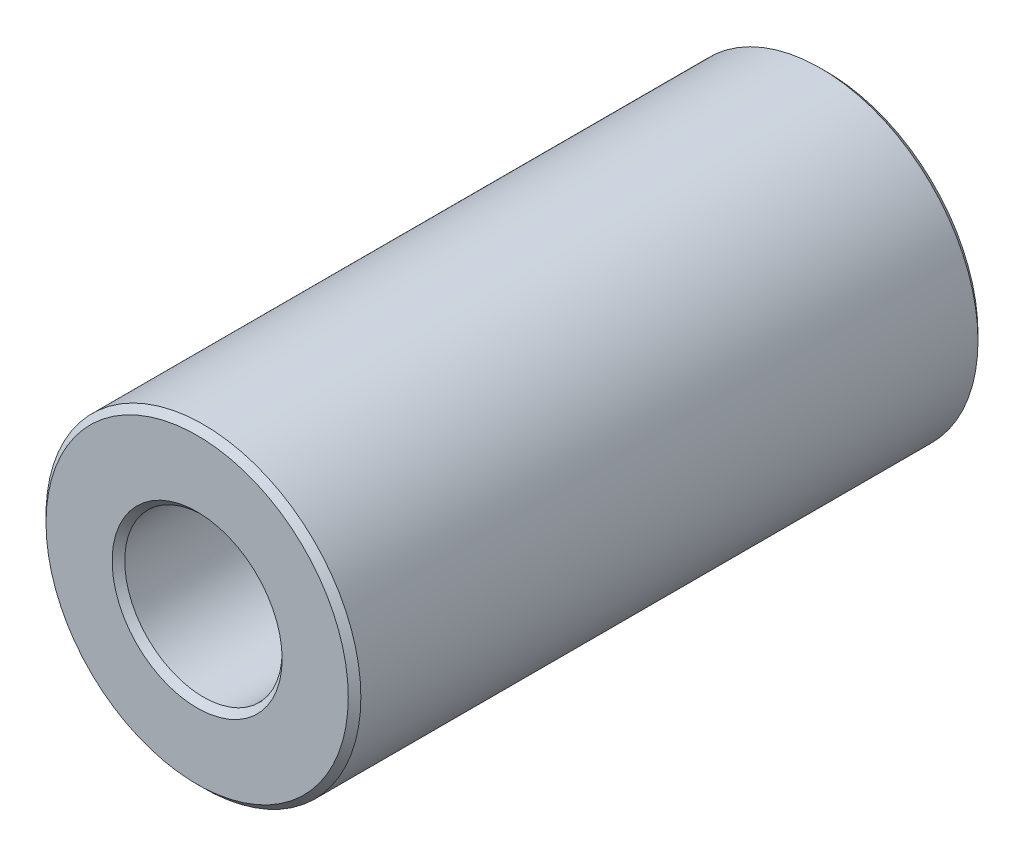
from build123d import *

# Parameters (mm, degrees)
SKETCH1_R           = 2.5
SKETCH1_R_2         = 1.25
BOSS_EXTRUDE2_DEPTH = 5
CHAMFER3_SIZE       = 0.1


with BuildPart() as part:
    # Sketch1 → Boss-Extrude2 (new, symmetric)
    with BuildSketch(Plane.XY):
        Circle(SKETCH1_R)
        Circle(SKETCH1_R_2, mode=Mode.SUBTRACT)
    extrude(amount=BOSS_EXTRUDE2_DEPTH, both=True)

    # Chamfer3
    chamfer3_edges = [part.edges().sort_by_distance(p)[0] for p in [
        (-2.5, 0, -5),
        (-2.5, 0, 5),
        (-1.25, 0, -5),
        (-1.25, 0, 5),
    ]]
    chamfer(chamfer3_edges, length=CHAMFER3_SIZE)


solid = part.part
